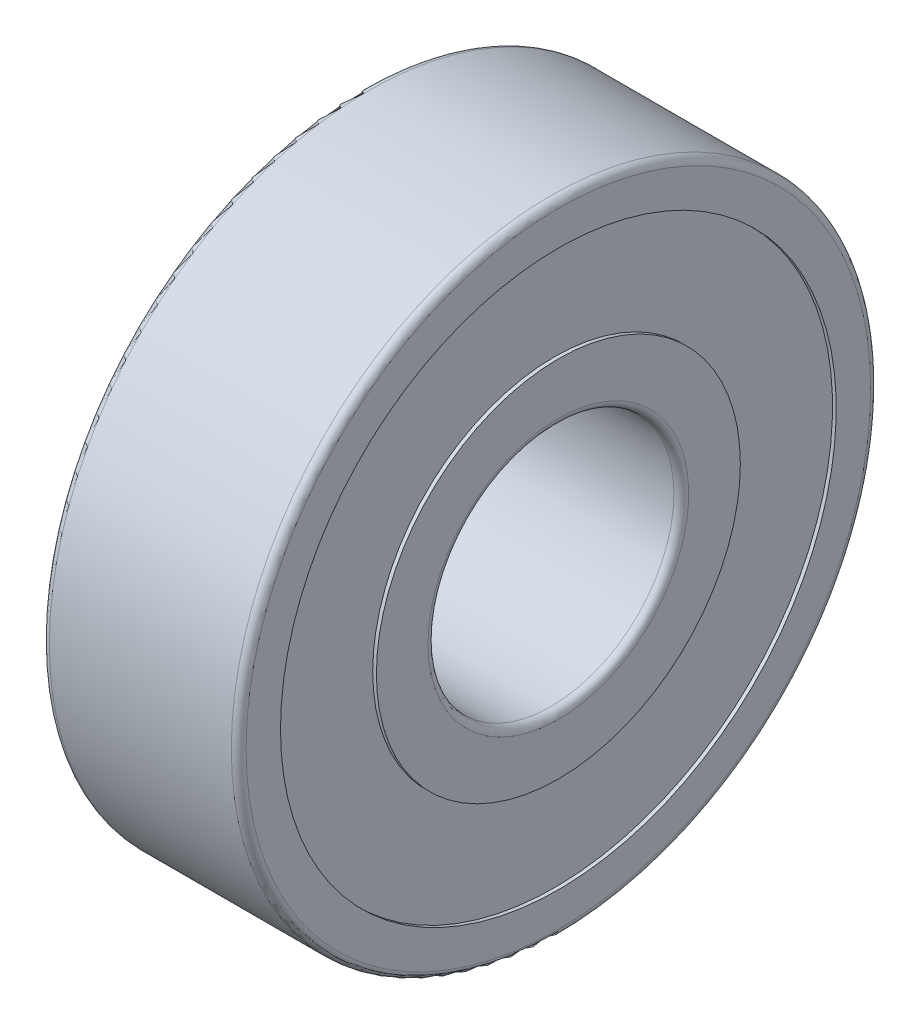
ISO-10303-21;
HEADER;
FILE_DESCRIPTION(('STEP AP214'),'2;1');
FILE_NAME('part.step','',(''),(''),'','','');
FILE_SCHEMA(('AUTOMOTIVE_DESIGN { 1 0 10303 214 1 1 1 1 }'));
ENDSEC;
DATA;
#1=APPLICATION_CONTEXT('core data for automotive mechanical design processes');
#2=APPLICATION_PROTOCOL_DEFINITION('international standard','automotive_design',2000,#1);
#3=PRODUCT_CONTEXT('',#1,'mechanical');
#4=PRODUCT('Part','Part','',(#3));
#5=PRODUCT_RELATED_PRODUCT_CATEGORY('part','',(#4));
#6=PRODUCT_DEFINITION_FORMATION('','',#4);
#7=PRODUCT_DEFINITION_CONTEXT('part definition',#1,'design');
#8=PRODUCT_DEFINITION('design','',#6,#7);
#9=PRODUCT_DEFINITION_SHAPE('','',#8);
#10=(LENGTH_UNIT() NAMED_UNIT(*) SI_UNIT(.MILLI.,.METRE.));
#11=(NAMED_UNIT(*) PLANE_ANGLE_UNIT() SI_UNIT($,.RADIAN.));
#12=(NAMED_UNIT(*) SI_UNIT($,.STERADIAN.) SOLID_ANGLE_UNIT());
#13=UNCERTAINTY_MEASURE_WITH_UNIT(LENGTH_MEASURE(1.E-05),#10,'distance_accuracy_value','');
#14=(GEOMETRIC_REPRESENTATION_CONTEXT(3) GLOBAL_UNCERTAINTY_ASSIGNED_CONTEXT((#13)) GLOBAL_UNIT_ASSIGNED_CONTEXT((#10,
#11,#12)) REPRESENTATION_CONTEXT('',''));
#15=CARTESIAN_POINT('',(0.,0.,0.));
#16=DIRECTION('',(0.,0.,1.));
#17=DIRECTION('',(1.,0.,0.));
#18=AXIS2_PLACEMENT_3D('',#15,#16,#17);
#19=CARTESIAN_POINT('',(-3.7,0.,0.));
#20=DIRECTION('',(1.,0.,0.));
#21=DIRECTION('',(0.,0.,1.));
#22=AXIS2_PLACEMENT_3D('',#19,#20,#21);
#23=TOROIDAL_SURFACE('',#22,5.3,0.3);
#24=CARTESIAN_POINT('',(-4.,0.,0.));
#25=DIRECTION('',(-1.,0.,0.));
#26=DIRECTION('',(0.,0.,1.));
#27=AXIS2_PLACEMENT_3D('',#24,#25,#26);
#28=CIRCLE('',#27,5.3);
#29=CARTESIAN_POINT('',(-4.,0.,5.3));
#30=VERTEX_POINT('',#29);
#31=EDGE_CURVE('E110',#30,#30,#28,.T.);
#32=ORIENTED_EDGE('',*,*,#31,.T.);
#33=EDGE_LOOP('',(#32));
#34=FACE_BOUND('',#33,.T.);
#35=CARTESIAN_POINT('',(-3.7,0.,0.));
#36=DIRECTION('',(1.,0.,0.));
#37=DIRECTION('',(0.,0.,1.));
#38=AXIS2_PLACEMENT_3D('',#35,#36,#37);
#39=CIRCLE('',#38,5.);
#40=CARTESIAN_POINT('',(-3.7,0.,5.));
#41=VERTEX_POINT('',#40);
#42=EDGE_CURVE('E102',#41,#41,#39,.T.);
#43=ORIENTED_EDGE('',*,*,#42,.T.);
#44=EDGE_LOOP('',(#43));
#45=FACE_BOUND('',#44,.T.);
#46=ADVANCED_FACE('F15',(#34,#45),#23,.T.);
#47=CARTESIAN_POINT('',(-3.7,0.,0.));
#48=DIRECTION('',(1.,0.,0.));
#49=DIRECTION('',(0.,0.,1.));
#50=AXIS2_PLACEMENT_3D('',#47,#48,#49);
#51=TOROIDAL_SURFACE('',#50,12.7,0.3);
#52=CARTESIAN_POINT('',(-3.7,0.,0.));
#53=DIRECTION('',(-1.,0.,0.));
#54=DIRECTION('',(0.,0.,1.));
#55=AXIS2_PLACEMENT_3D('',#52,#53,#54);
#56=CIRCLE('',#55,13.);
#57=CARTESIAN_POINT('',(-3.7,0.,13.));
#58=VERTEX_POINT('',#57);
#59=EDGE_CURVE('E114',#58,#58,#56,.T.);
#60=ORIENTED_EDGE('',*,*,#59,.T.);
#61=EDGE_LOOP('',(#60));
#62=FACE_BOUND('',#61,.T.);
#63=CARTESIAN_POINT('',(-4.,0.,0.));
#64=DIRECTION('',(1.,0.,0.));
#65=DIRECTION('',(0.,0.,1.));
#66=AXIS2_PLACEMENT_3D('',#63,#64,#65);
#67=CIRCLE('',#66,12.7);
#68=CARTESIAN_POINT('',(-4.,0.,12.7));
#69=VERTEX_POINT('',#68);
#70=EDGE_CURVE('E9',#69,#69,#67,.T.);
#71=ORIENTED_EDGE('',*,*,#70,.T.);
#72=EDGE_LOOP('',(#71));
#73=FACE_BOUND('',#72,.T.);
#74=ADVANCED_FACE('F161',(#62,#73),#51,.T.);
#75=CARTESIAN_POINT('',(-4.,0.,12.15));
#76=DIRECTION('',(1.,0.,0.));
#77=DIRECTION('',(0.,1.,0.));
#78=AXIS2_PLACEMENT_3D('',#75,#76,#77);
#79=PLANE('',#78);
#80=CARTESIAN_POINT('',(-4.,0.,0.));
#81=DIRECTION('',(-1.,0.,0.));
#82=DIRECTION('',(0.,0.,1.));
#83=AXIS2_PLACEMENT_3D('',#80,#81,#82);
#84=CIRCLE('',#83,11.3);
#85=CARTESIAN_POINT('',(-4.,0.,11.3));
#86=VERTEX_POINT('',#85);
#87=EDGE_CURVE('E24',#86,#86,#84,.T.);
#88=ORIENTED_EDGE('',*,*,#87,.F.);
#89=EDGE_LOOP('',(#88));
#90=FACE_BOUND('',#89,.T.);
#91=ORIENTED_EDGE('',*,*,#70,.F.);
#92=EDGE_LOOP('',(#91));
#93=FACE_BOUND('',#92,.T.);
#94=ADVANCED_FACE('F151',(#90,#93),#79,.F.);
#95=CARTESIAN_POINT('',(-2.,0.,0.));
#96=DIRECTION('',(1.,0.,0.));
#97=DIRECTION('',(0.,0.,1.));
#98=AXIS2_PLACEMENT_3D('',#95,#96,#97);
#99=CYLINDRICAL_SURFACE('',#98,11.3);
#100=CARTESIAN_POINT('',(-3.85,0.,0.));
#101=DIRECTION('',(-1.,0.,0.));
#102=DIRECTION('',(0.,0.,1.));
#103=AXIS2_PLACEMENT_3D('',#100,#101,#102);
#104=CIRCLE('',#103,11.3);
#105=CARTESIAN_POINT('',(-3.85,0.,11.3));
#106=VERTEX_POINT('',#105);
#107=EDGE_CURVE('E18',#106,#106,#104,.T.);
#108=ORIENTED_EDGE('',*,*,#107,.F.);
#109=EDGE_LOOP('',(#108));
#110=FACE_BOUND('',#109,.T.);
#111=ORIENTED_EDGE('',*,*,#87,.T.);
#112=EDGE_LOOP('',(#111));
#113=FACE_BOUND('',#112,.T.);
#114=ADVANCED_FACE('F149',(#110,#113),#99,.F.);
#115=CARTESIAN_POINT('',(-3.85,0.,9.35));
#116=DIRECTION('',(1.,0.,0.));
#117=DIRECTION('',(0.,1.,0.));
#118=AXIS2_PLACEMENT_3D('',#115,#116,#117);
#119=PLANE('',#118);
#120=CARTESIAN_POINT('',(-3.85,0.,0.));
#121=DIRECTION('',(-1.,0.,0.));
#122=DIRECTION('',(0.,0.,1.));
#123=AXIS2_PLACEMENT_3D('',#120,#121,#122);
#124=CIRCLE('',#123,7.4);
#125=CARTESIAN_POINT('',(-3.85,0.,7.4));
#126=VERTEX_POINT('',#125);
#127=EDGE_CURVE('E139',#126,#126,#124,.T.);
#128=ORIENTED_EDGE('',*,*,#127,.F.);
#129=EDGE_LOOP('',(#128));
#130=FACE_BOUND('',#129,.T.);
#131=ORIENTED_EDGE('',*,*,#107,.T.);
#132=EDGE_LOOP('',(#131));
#133=FACE_BOUND('',#132,.T.);
#134=ADVANCED_FACE('F147',(#130,#133),#119,.F.);
#135=CARTESIAN_POINT('',(-2.,0.,0.));
#136=DIRECTION('',(1.,0.,0.));
#137=DIRECTION('',(0.,0.,1.));
#138=AXIS2_PLACEMENT_3D('',#135,#136,#137);
#139=CYLINDRICAL_SURFACE('',#138,7.4);
#140=CARTESIAN_POINT('',(-4.,0.,0.));
#141=DIRECTION('',(-1.,0.,0.));
#142=DIRECTION('',(0.,0.,1.));
#143=AXIS2_PLACEMENT_3D('',#140,#141,#142);
#144=CIRCLE('',#143,7.4);
#145=CARTESIAN_POINT('',(-4.,0.,7.4));
#146=VERTEX_POINT('',#145);
#147=EDGE_CURVE('E113',#146,#146,#144,.T.);
#148=ORIENTED_EDGE('',*,*,#147,.F.);
#149=EDGE_LOOP('',(#148));
#150=FACE_BOUND('',#149,.T.);
#151=ORIENTED_EDGE('',*,*,#127,.T.);
#152=EDGE_LOOP('',(#151));
#153=FACE_BOUND('',#152,.T.);
#154=ADVANCED_FACE('F158',(#150,#153),#139,.T.);
#155=CARTESIAN_POINT('',(-4.,0.,6.2));
#156=DIRECTION('',(1.,0.,0.));
#157=DIRECTION('',(0.,1.,0.));
#158=AXIS2_PLACEMENT_3D('',#155,#156,#157);
#159=PLANE('',#158);
#160=ORIENTED_EDGE('',*,*,#147,.T.);
#161=EDGE_LOOP('',(#160));
#162=FACE_BOUND('',#161,.T.);
#163=ORIENTED_EDGE('',*,*,#31,.F.);
#164=EDGE_LOOP('',(#163));
#165=FACE_BOUND('',#164,.T.);
#166=ADVANCED_FACE('F204',(#162,#165),#159,.F.);
#167=CARTESIAN_POINT('',(3.7,0.,0.));
#168=DIRECTION('',(-1.,0.,0.));
#169=DIRECTION('',(0.,0.,1.));
#170=AXIS2_PLACEMENT_3D('',#167,#168,#169);
#171=TOROIDAL_SURFACE('',#170,5.3,0.3);
#172=CARTESIAN_POINT('',(4.,0.,0.));
#173=DIRECTION('',(-1.,0.,0.));
#174=DIRECTION('',(0.,0.,1.));
#175=AXIS2_PLACEMENT_3D('',#172,#173,#174);
#176=CIRCLE('',#175,5.3);
#177=CARTESIAN_POINT('',(4.,0.,5.3));
#178=VERTEX_POINT('',#177);
#179=EDGE_CURVE('E107',#178,#178,#176,.T.);
#180=ORIENTED_EDGE('',*,*,#179,.F.);
#181=EDGE_LOOP('',(#180));
#182=FACE_BOUND('',#181,.T.);
#183=CARTESIAN_POINT('',(3.7,0.,0.));
#184=DIRECTION('',(1.,0.,0.));
#185=DIRECTION('',(0.,0.,1.));
#186=AXIS2_PLACEMENT_3D('',#183,#184,#185);
#187=CIRCLE('',#186,5.);
#188=CARTESIAN_POINT('',(3.7,0.,5.));
#189=VERTEX_POINT('',#188);
#190=EDGE_CURVE('E98',#189,#189,#187,.T.);
#191=ORIENTED_EDGE('',*,*,#190,.F.);
#192=EDGE_LOOP('',(#191));
#193=FACE_BOUND('',#192,.T.);
#194=ADVANCED_FACE('F207',(#182,#193),#171,.T.);
#195=CARTESIAN_POINT('',(3.7,0.,0.));
#196=DIRECTION('',(-1.,0.,0.));
#197=DIRECTION('',(0.,0.,1.));
#198=AXIS2_PLACEMENT_3D('',#195,#196,#197);
#199=TOROIDAL_SURFACE('',#198,12.7,0.3);
#200=CARTESIAN_POINT('',(3.7,0.,0.));
#201=DIRECTION('',(-1.,0.,0.));
#202=DIRECTION('',(0.,0.,1.));
#203=AXIS2_PLACEMENT_3D('',#200,#201,#202);
#204=CIRCLE('',#203,13.);
#205=CARTESIAN_POINT('',(3.7,0.,13.));
#206=VERTEX_POINT('',#205);
#207=EDGE_CURVE('E115',#206,#206,#204,.T.);
#208=ORIENTED_EDGE('',*,*,#207,.F.);
#209=EDGE_LOOP('',(#208));
#210=FACE_BOUND('',#209,.T.);
#211=CARTESIAN_POINT('',(4.,0.,0.));
#212=DIRECTION('',(1.,0.,0.));
#213=DIRECTION('',(0.,0.,1.));
#214=AXIS2_PLACEMENT_3D('',#211,#212,#213);
#215=CIRCLE('',#214,12.7);
#216=CARTESIAN_POINT('',(4.,0.,12.7));
#217=VERTEX_POINT('',#216);
#218=EDGE_CURVE('E118',#217,#217,#215,.T.);
#219=ORIENTED_EDGE('',*,*,#218,.F.);
#220=EDGE_LOOP('',(#219));
#221=FACE_BOUND('',#220,.T.);
#222=ADVANCED_FACE('F196',(#210,#221),#199,.T.);
#223=CARTESIAN_POINT('',(2.,0.,0.));
#224=DIRECTION('',(-1.,0.,0.));
#225=DIRECTION('',(0.,0.,1.));
#226=AXIS2_PLACEMENT_3D('',#223,#224,#225);
#227=CYLINDRICAL_SURFACE('',#226,13.);
#228=ORIENTED_EDGE('',*,*,#59,.F.);
#229=EDGE_LOOP('',(#228));
#230=FACE_BOUND('',#229,.T.);
#231=ORIENTED_EDGE('',*,*,#207,.T.);
#232=EDGE_LOOP('',(#231));
#233=FACE_BOUND('',#232,.T.);
#234=ADVANCED_FACE('F192',(#230,#233),#227,.T.);
#235=CARTESIAN_POINT('',(4.,0.,12.15));
#236=DIRECTION('',(-1.,0.,0.));
#237=DIRECTION('',(0.,0.,1.));
#238=AXIS2_PLACEMENT_3D('',#235,#236,#237);
#239=PLANE('',#238);
#240=CARTESIAN_POINT('',(4.,0.,0.));
#241=DIRECTION('',(-1.,0.,0.));
#242=DIRECTION('',(0.,0.,1.));
#243=AXIS2_PLACEMENT_3D('',#240,#241,#242);
#244=CIRCLE('',#243,11.3);
#245=CARTESIAN_POINT('',(4.,0.,11.3));
#246=VERTEX_POINT('',#245);
#247=EDGE_CURVE('E124',#246,#246,#244,.T.);
#248=ORIENTED_EDGE('',*,*,#247,.T.);
#249=EDGE_LOOP('',(#248));
#250=FACE_BOUND('',#249,.T.);
#251=ORIENTED_EDGE('',*,*,#218,.T.);
#252=EDGE_LOOP('',(#251));
#253=FACE_BOUND('',#252,.T.);
#254=ADVANCED_FACE('F195',(#250,#253),#239,.F.);
#255=CARTESIAN_POINT('',(2.,0.,0.));
#256=DIRECTION('',(-1.,0.,0.));
#257=DIRECTION('',(0.,0.,1.));
#258=AXIS2_PLACEMENT_3D('',#255,#256,#257);
#259=CYLINDRICAL_SURFACE('',#258,11.3);
#260=CARTESIAN_POINT('',(3.85,0.,0.));
#261=DIRECTION('',(-1.,0.,0.));
#262=DIRECTION('',(0.,0.,1.));
#263=AXIS2_PLACEMENT_3D('',#260,#261,#262);
#264=CIRCLE('',#263,11.3);
#265=CARTESIAN_POINT('',(3.85,0.,11.3));
#266=VERTEX_POINT('',#265);
#267=EDGE_CURVE('E129',#266,#266,#264,.T.);
#268=ORIENTED_EDGE('',*,*,#267,.T.);
#269=EDGE_LOOP('',(#268));
#270=FACE_BOUND('',#269,.T.);
#271=ORIENTED_EDGE('',*,*,#247,.F.);
#272=EDGE_LOOP('',(#271));
#273=FACE_BOUND('',#272,.T.);
#274=ADVANCED_FACE('F190',(#270,#273),#259,.F.);
#275=CARTESIAN_POINT('',(3.85,0.,9.35));
#276=DIRECTION('',(-1.,0.,0.));
#277=DIRECTION('',(0.,0.,1.));
#278=AXIS2_PLACEMENT_3D('',#275,#276,#277);
#279=PLANE('',#278);
#280=CARTESIAN_POINT('',(3.85,0.,0.));
#281=DIRECTION('',(-1.,0.,0.));
#282=DIRECTION('',(0.,0.,1.));
#283=AXIS2_PLACEMENT_3D('',#280,#281,#282);
#284=CIRCLE('',#283,7.4);
#285=CARTESIAN_POINT('',(3.85,0.,7.4));
#286=VERTEX_POINT('',#285);
#287=EDGE_CURVE('E127',#286,#286,#284,.T.);
#288=ORIENTED_EDGE('',*,*,#287,.T.);
#289=EDGE_LOOP('',(#288));
#290=FACE_BOUND('',#289,.T.);
#291=ORIENTED_EDGE('',*,*,#267,.F.);
#292=EDGE_LOOP('',(#291));
#293=FACE_BOUND('',#292,.T.);
#294=ADVANCED_FACE('F185',(#290,#293),#279,.F.);
#295=CARTESIAN_POINT('',(2.,0.,0.));
#296=DIRECTION('',(-1.,0.,0.));
#297=DIRECTION('',(0.,0.,1.));
#298=AXIS2_PLACEMENT_3D('',#295,#296,#297);
#299=CYLINDRICAL_SURFACE('',#298,7.4);
#300=CARTESIAN_POINT('',(4.,0.,0.));
#301=DIRECTION('',(-1.,0.,0.));
#302=DIRECTION('',(0.,0.,1.));
#303=AXIS2_PLACEMENT_3D('',#300,#301,#302);
#304=CIRCLE('',#303,7.4);
#305=CARTESIAN_POINT('',(4.,0.,7.4));
#306=VERTEX_POINT('',#305);
#307=EDGE_CURVE('E121',#306,#306,#304,.T.);
#308=ORIENTED_EDGE('',*,*,#307,.T.);
#309=EDGE_LOOP('',(#308));
#310=FACE_BOUND('',#309,.T.);
#311=ORIENTED_EDGE('',*,*,#287,.F.);
#312=EDGE_LOOP('',(#311));
#313=FACE_BOUND('',#312,.T.);
#314=ADVANCED_FACE('F180',(#310,#313),#299,.T.);
#315=CARTESIAN_POINT('',(4.,0.,6.2));
#316=DIRECTION('',(-1.,0.,0.));
#317=DIRECTION('',(0.,0.,1.));
#318=AXIS2_PLACEMENT_3D('',#315,#316,#317);
#319=PLANE('',#318);
#320=ORIENTED_EDGE('',*,*,#307,.F.);
#321=EDGE_LOOP('',(#320));
#322=FACE_BOUND('',#321,.T.);
#323=ORIENTED_EDGE('',*,*,#179,.T.);
#324=EDGE_LOOP('',(#323));
#325=FACE_BOUND('',#324,.T.);
#326=ADVANCED_FACE('F175',(#322,#325),#319,.F.);
#327=CARTESIAN_POINT('',(2.,0.,0.));
#328=DIRECTION('',(-1.,0.,0.));
#329=DIRECTION('',(0.,0.,1.));
#330=AXIS2_PLACEMENT_3D('',#327,#328,#329);
#331=CYLINDRICAL_SURFACE('',#330,5.);
#332=ORIENTED_EDGE('',*,*,#42,.F.);
#333=EDGE_LOOP('',(#332));
#334=FACE_BOUND('',#333,.T.);
#335=ORIENTED_EDGE('',*,*,#190,.T.);
#336=EDGE_LOOP('',(#335));
#337=FACE_BOUND('',#336,.T.);
#338=ADVANCED_FACE('F99',(#334,#337),#331,.F.);
#339=CLOSED_SHELL('',(#46,#74,#94,#114,#134,#154,#166,#194,#222,#234,#254,#274,#294,#314,#326,#338));
#340=MANIFOLD_SOLID_BREP('B1',#339);
#341=ADVANCED_BREP_SHAPE_REPRESENTATION('',(#18,#340),#14);
#342=SHAPE_DEFINITION_REPRESENTATION(#9,#341);
ENDSEC;
END-ISO-10303-21;
